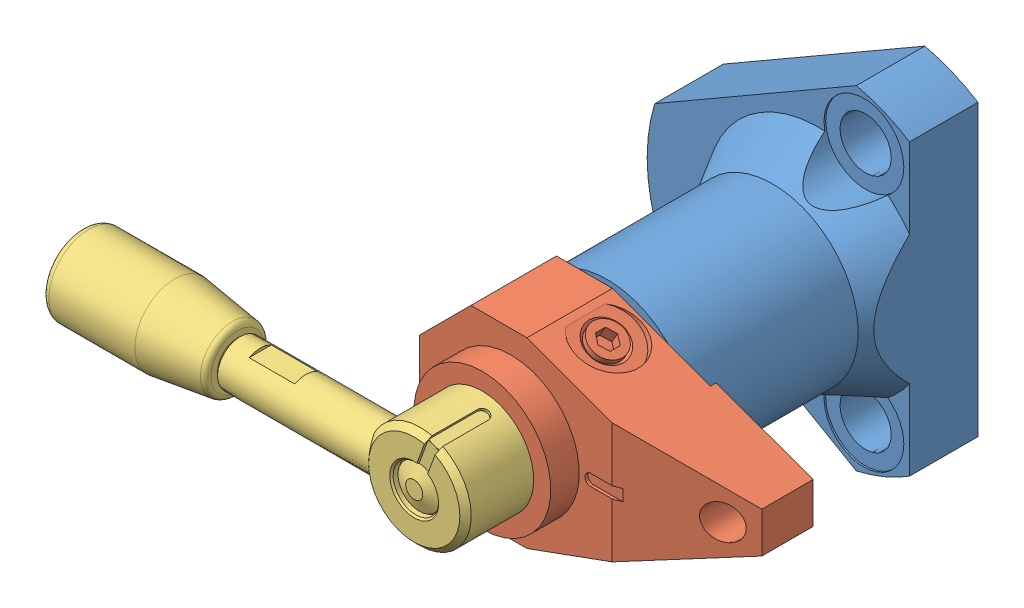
SolidWorks assembly QLSWW30R-100.sldasm, configuration Default (file format 15000). Lengths in mm.
Overall size (103.34 58.5 85.84).
3 component instances, 3 part files, 0 mates.
Components (placement in the parent):
- QLSWW30R-100_01-1: QLSWW30R-100_01.SLDPRT [ﾃﾞﾌｫﾙﾄ] x (0 1 0) z (1 0 0) size (58.5 49 46)
- QLSWW30R-100_02-1: QLSWW30R-100_02.SLDPRT [ﾃﾞﾌｫﾙﾄ] at (0 0 62.95) x (0 1 0) z (1 0 0) size (32 69.65 53)
- QLSWW30R-100_03-1: QLSWW30R-100_03.SLDPRT [ﾃﾞﾌｫﾙﾄ] at (0 0 59.8408) x (-0.34202 -0.939693 0) z (-0.939693 0.34202 0) size (36.53 40.55 69.58)
